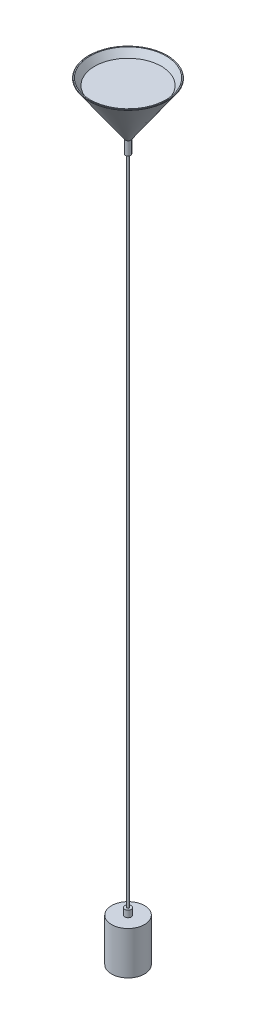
ISO-10303-21;
HEADER;
FILE_DESCRIPTION(('STEP AP214'),'2;1');
FILE_NAME('part.step','',(''),(''),'','','');
FILE_SCHEMA(('AUTOMOTIVE_DESIGN { 1 0 10303 214 1 1 1 1 }'));
ENDSEC;
DATA;
#1=APPLICATION_CONTEXT('core data for automotive mechanical design processes');
#2=APPLICATION_PROTOCOL_DEFINITION('international standard','automotive_design',2000,#1);
#3=PRODUCT_CONTEXT('',#1,'mechanical');
#4=PRODUCT('Part','Part','',(#3));
#5=PRODUCT_RELATED_PRODUCT_CATEGORY('part','',(#4));
#6=PRODUCT_DEFINITION_FORMATION('','',#4);
#7=PRODUCT_DEFINITION_CONTEXT('part definition',#1,'design');
#8=PRODUCT_DEFINITION('design','',#6,#7);
#9=PRODUCT_DEFINITION_SHAPE('','',#8);
#10=(LENGTH_UNIT() NAMED_UNIT(*) SI_UNIT(.MILLI.,.METRE.));
#11=(NAMED_UNIT(*) PLANE_ANGLE_UNIT() SI_UNIT($,.RADIAN.));
#12=(NAMED_UNIT(*) SI_UNIT($,.STERADIAN.) SOLID_ANGLE_UNIT());
#13=UNCERTAINTY_MEASURE_WITH_UNIT(LENGTH_MEASURE(1.E-05),#10,'distance_accuracy_value','');
#14=(GEOMETRIC_REPRESENTATION_CONTEXT(3) GLOBAL_UNCERTAINTY_ASSIGNED_CONTEXT((#13)) GLOBAL_UNIT_ASSIGNED_CONTEXT((#10,
#11,#12)) REPRESENTATION_CONTEXT('',''));
#15=CARTESIAN_POINT('',(0.,0.,0.));
#16=DIRECTION('',(0.,0.,1.));
#17=DIRECTION('',(1.,0.,0.));
#18=AXIS2_PLACEMENT_3D('',#15,#16,#17);
#19=CARTESIAN_POINT('',(0.,-1010.,0.));
#20=DIRECTION('',(0.,-1.,0.));
#21=DIRECTION('',(0.,0.,-1.));
#22=AXIS2_PLACEMENT_3D('',#19,#20,#21);
#23=CYLINDRICAL_SURFACE('',#22,5.);
#24=CARTESIAN_POINT('',(0.,-1010.,0.));
#25=DIRECTION('',(0.,1.,0.));
#26=DIRECTION('',(0.,0.,1.));
#27=AXIS2_PLACEMENT_3D('',#24,#25,#26);
#28=CIRCLE('',#27,5.);
#29=CARTESIAN_POINT('',(0.,-1010.,5.));
#30=VERTEX_POINT('',#29);
#31=EDGE_CURVE('E11',#30,#30,#28,.T.);
#32=ORIENTED_EDGE('',*,*,#31,.F.);
#33=EDGE_LOOP('',(#32));
#34=FACE_BOUND('',#33,.T.);
#35=CARTESIAN_POINT('',(0.,-1020.,0.));
#36=DIRECTION('',(0.,1.,0.));
#37=DIRECTION('',(0.,0.,1.));
#38=AXIS2_PLACEMENT_3D('',#35,#36,#37);
#39=CIRCLE('',#38,5.);
#40=CARTESIAN_POINT('',(0.,-1020.,5.));
#41=VERTEX_POINT('',#40);
#42=EDGE_CURVE('E44',#41,#41,#39,.T.);
#43=ORIENTED_EDGE('',*,*,#42,.T.);
#44=EDGE_LOOP('',(#43));
#45=FACE_BOUND('',#44,.T.);
#46=ADVANCED_FACE('F41',(#34,#45),#23,.T.);
#47=CARTESIAN_POINT('',(0.,-1010.,0.));
#48=DIRECTION('',(0.,1.,0.));
#49=DIRECTION('',(0.,0.,1.));
#50=AXIS2_PLACEMENT_3D('',#47,#48,#49);
#51=PLANE('',#50);
#52=ORIENTED_EDGE('',*,*,#31,.T.);
#53=EDGE_LOOP('',(#52));
#54=FACE_BOUND('',#53,.T.);
#55=ADVANCED_FACE('F56',(#54),#51,.T.);
#56=CARTESIAN_POINT('',(0.,-1020.,0.));
#57=DIRECTION('',(0.,1.,0.));
#58=DIRECTION('',(0.,0.,1.));
#59=AXIS2_PLACEMENT_3D('',#56,#57,#58);
#60=PLANE('',#59);
#61=ORIENTED_EDGE('',*,*,#42,.F.);
#62=EDGE_LOOP('',(#61));
#63=FACE_BOUND('',#62,.T.);
#64=ADVANCED_FACE('F54',(#63),#60,.F.);
#65=CLOSED_SHELL('',(#46,#55,#64));
#66=MANIFOLD_SOLID_BREP('B2',#65);
#67=CARTESIAN_POINT('',(0.,-1085.,0.));
#68=DIRECTION('',(0.,1.,0.));
#69=DIRECTION('',(0.,0.,1.));
#70=AXIS2_PLACEMENT_3D('',#67,#68,#69);
#71=CYLINDRICAL_SURFACE('',#70,25.);
#72=CARTESIAN_POINT('',(0.,-1085.,0.));
#73=DIRECTION('',(0.,-1.,0.));
#74=DIRECTION('',(0.,0.,-1.));
#75=AXIS2_PLACEMENT_3D('',#72,#73,#74);
#76=CIRCLE('',#75,25.);
#77=CARTESIAN_POINT('',(0.,-1085.,-25.));
#78=VERTEX_POINT('',#77);
#79=EDGE_CURVE('E40',#78,#78,#76,.T.);
#80=ORIENTED_EDGE('',*,*,#79,.F.);
#81=EDGE_LOOP('',(#80));
#82=FACE_BOUND('',#81,.T.);
#83=CARTESIAN_POINT('',(0.,-1020.,0.));
#84=DIRECTION('',(0.,-1.,0.));
#85=DIRECTION('',(0.,0.,-1.));
#86=AXIS2_PLACEMENT_3D('',#83,#84,#85);
#87=CIRCLE('',#86,25.);
#88=CARTESIAN_POINT('',(0.,-1020.,-25.));
#89=VERTEX_POINT('',#88);
#90=EDGE_CURVE('E92',#89,#89,#87,.T.);
#91=ORIENTED_EDGE('',*,*,#90,.T.);
#92=EDGE_LOOP('',(#91));
#93=FACE_BOUND('',#92,.T.);
#94=ADVANCED_FACE('F89',(#82,#93),#71,.T.);
#95=CARTESIAN_POINT('',(0.,-1085.,0.));
#96=DIRECTION('',(0.,-1.,0.));
#97=DIRECTION('',(0.,0.,-1.));
#98=AXIS2_PLACEMENT_3D('',#95,#96,#97);
#99=PLANE('',#98);
#100=ORIENTED_EDGE('',*,*,#79,.T.);
#101=EDGE_LOOP('',(#100));
#102=FACE_BOUND('',#101,.T.);
#103=ADVANCED_FACE('F104',(#102),#99,.T.);
#104=CARTESIAN_POINT('',(0.,-1020.,0.));
#105=DIRECTION('',(0.,-1.,0.));
#106=DIRECTION('',(0.,0.,-1.));
#107=AXIS2_PLACEMENT_3D('',#104,#105,#106);
#108=PLANE('',#107);
#109=ORIENTED_EDGE('',*,*,#90,.F.);
#110=EDGE_LOOP('',(#109));
#111=FACE_BOUND('',#110,.T.);
#112=ADVANCED_FACE('F102',(#111),#108,.F.);
#113=CLOSED_SHELL('',(#94,#103,#112));
#114=MANIFOLD_SOLID_BREP('B6',#113);
#115=CARTESIAN_POINT('',(0.,-1020.,0.));
#116=DIRECTION('',(0.,1.,0.));
#117=DIRECTION('',(0.,0.,1.));
#118=AXIS2_PLACEMENT_3D('',#115,#116,#117);
#119=CYLINDRICAL_SURFACE('',#118,1.5);
#120=CARTESIAN_POINT('',(0.,-1020.,0.));
#121=DIRECTION('',(0.,-1.,0.));
#122=DIRECTION('',(0.,0.,-1.));
#123=AXIS2_PLACEMENT_3D('',#120,#121,#122);
#124=CIRCLE('',#123,1.5);
#125=CARTESIAN_POINT('',(0.,-1020.,-1.5));
#126=VERTEX_POINT('',#125);
#127=EDGE_CURVE('E88',#126,#126,#124,.T.);
#128=ORIENTED_EDGE('',*,*,#127,.F.);
#129=EDGE_LOOP('',(#128));
#130=FACE_BOUND('',#129,.T.);
#131=CARTESIAN_POINT('',(0.,-20.,0.));
#132=DIRECTION('',(0.,-1.,0.));
#133=DIRECTION('',(0.,0.,-1.));
#134=AXIS2_PLACEMENT_3D('',#131,#132,#133);
#135=CIRCLE('',#134,1.5);
#136=CARTESIAN_POINT('',(0.,-20.,-1.5));
#137=VERTEX_POINT('',#136);
#138=EDGE_CURVE('E140',#137,#137,#135,.T.);
#139=ORIENTED_EDGE('',*,*,#138,.T.);
#140=EDGE_LOOP('',(#139));
#141=FACE_BOUND('',#140,.T.);
#142=ADVANCED_FACE('F137',(#130,#141),#119,.T.);
#143=CARTESIAN_POINT('',(0.,-1020.,0.));
#144=DIRECTION('',(0.,-1.,0.));
#145=DIRECTION('',(0.,0.,-1.));
#146=AXIS2_PLACEMENT_3D('',#143,#144,#145);
#147=PLANE('',#146);
#148=ORIENTED_EDGE('',*,*,#127,.T.);
#149=EDGE_LOOP('',(#148));
#150=FACE_BOUND('',#149,.T.);
#151=ADVANCED_FACE('F152',(#150),#147,.T.);
#152=CARTESIAN_POINT('',(0.,-20.,0.));
#153=DIRECTION('',(0.,-1.,0.));
#154=DIRECTION('',(0.,0.,-1.));
#155=AXIS2_PLACEMENT_3D('',#152,#153,#154);
#156=PLANE('',#155);
#157=ORIENTED_EDGE('',*,*,#138,.F.);
#158=EDGE_LOOP('',(#157));
#159=FACE_BOUND('',#158,.T.);
#160=ADVANCED_FACE('F150',(#159),#156,.F.);
#161=CLOSED_SHELL('',(#142,#151,#160));
#162=MANIFOLD_SOLID_BREP('B35',#161);
#163=CARTESIAN_POINT('',(0.,-20.,0.));
#164=DIRECTION('',(0.,1.,0.));
#165=DIRECTION('',(0.,0.,1.));
#166=AXIS2_PLACEMENT_3D('',#163,#164,#165);
#167=CYLINDRICAL_SURFACE('',#166,4.);
#168=CARTESIAN_POINT('',(0.,-20.,0.));
#169=DIRECTION('',(0.,-1.,0.));
#170=DIRECTION('',(0.,0.,-1.));
#171=AXIS2_PLACEMENT_3D('',#168,#169,#170);
#172=CIRCLE('',#171,4.);
#173=CARTESIAN_POINT('',(0.,-20.,-4.));
#174=VERTEX_POINT('',#173);
#175=EDGE_CURVE('E136',#174,#174,#172,.T.);
#176=ORIENTED_EDGE('',*,*,#175,.F.);
#177=EDGE_LOOP('',(#176));
#178=FACE_BOUND('',#177,.T.);
#179=CARTESIAN_POINT('',(0.,0.,0.));
#180=DIRECTION('',(0.,-1.,0.));
#181=DIRECTION('',(0.,0.,-1.));
#182=AXIS2_PLACEMENT_3D('',#179,#180,#181);
#183=CIRCLE('',#182,4.);
#184=CARTESIAN_POINT('',(0.,0.,-4.));
#185=VERTEX_POINT('',#184);
#186=EDGE_CURVE('E188',#185,#185,#183,.T.);
#187=ORIENTED_EDGE('',*,*,#186,.T.);
#188=EDGE_LOOP('',(#187));
#189=FACE_BOUND('',#188,.T.);
#190=ADVANCED_FACE('F185',(#178,#189),#167,.T.);
#191=CARTESIAN_POINT('',(0.,-20.,0.));
#192=DIRECTION('',(0.,-1.,0.));
#193=DIRECTION('',(0.,0.,-1.));
#194=AXIS2_PLACEMENT_3D('',#191,#192,#193);
#195=PLANE('',#194);
#196=ORIENTED_EDGE('',*,*,#175,.T.);
#197=EDGE_LOOP('',(#196));
#198=FACE_BOUND('',#197,.T.);
#199=ADVANCED_FACE('F200',(#198),#195,.T.);
#200=CARTESIAN_POINT('',(0.,0.,0.));
#201=DIRECTION('',(0.,-1.,0.));
#202=DIRECTION('',(0.,0.,-1.));
#203=AXIS2_PLACEMENT_3D('',#200,#201,#202);
#204=PLANE('',#203);
#205=ORIENTED_EDGE('',*,*,#186,.F.);
#206=EDGE_LOOP('',(#205));
#207=FACE_BOUND('',#206,.T.);
#208=ADVANCED_FACE('F198',(#207),#204,.F.);
#209=CLOSED_SHELL('',(#190,#199,#208));
#210=MANIFOLD_SOLID_BREP('B83',#209);
#211=CARTESIAN_POINT('',(0.,69.5,0.));
#212=DIRECTION('',(0.,-1.,0.));
#213=DIRECTION('',(1.,0.,0.));
#214=AXIS2_PLACEMENT_3D('',#211,#212,#213);
#215=PLANE('',#214);
#216=CARTESIAN_POINT('',(0.,69.5,0.));
#217=DIRECTION('',(0.,-1.,0.));
#218=DIRECTION('',(1.,0.,0.));
#219=AXIS2_PLACEMENT_3D('',#216,#217,#218);
#220=CIRCLE('',#219,50.3735945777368);
#221=CARTESIAN_POINT('',(50.3735945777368,69.5,0.));
#222=VERTEX_POINT('',#221);
#223=EDGE_CURVE('E184',#222,#222,#220,.T.);
#224=ORIENTED_EDGE('',*,*,#223,.T.);
#225=EDGE_LOOP('',(#224));
#226=FACE_BOUND('',#225,.T.);
#227=ADVANCED_FACE('F232',(#226),#215,.T.);
#228=CARTESIAN_POINT('',(0.,69.5,0.));
#229=DIRECTION('',(0.,1.,0.));
#230=DIRECTION('',(-1.,0.,0.));
#231=AXIS2_PLACEMENT_3D('',#228,#229,#230);
#232=CONICAL_SURFACE('',#231,50.3735945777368,0.718829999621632);
#233=CARTESIAN_POINT('',(0.,70.,0.));
#234=DIRECTION('',(0.,-1.,0.));
#235=DIRECTION('',(1.,0.,0.));
#236=AXIS2_PLACEMENT_3D('',#233,#234,#235);
#237=CIRCLE('',#236,50.8110945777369);
#238=CARTESIAN_POINT('',(50.8110945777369,70.,0.));
#239=VERTEX_POINT('',#238);
#240=EDGE_CURVE('E238',#239,#239,#237,.T.);
#241=ORIENTED_EDGE('',*,*,#240,.T.);
#242=EDGE_LOOP('',(#241));
#243=FACE_BOUND('',#242,.T.);
#244=ORIENTED_EDGE('',*,*,#223,.F.);
#245=EDGE_LOOP('',(#244));
#246=FACE_BOUND('',#245,.T.);
#247=ADVANCED_FACE('F244',(#243,#246),#232,.T.);
#248=CARTESIAN_POINT('',(0.,70.,0.));
#249=DIRECTION('',(0.,1.,0.));
#250=DIRECTION('',(-1.,0.,0.));
#251=AXIS2_PLACEMENT_3D('',#248,#249,#250);
#252=PLANE('',#251);
#253=ORIENTED_EDGE('',*,*,#240,.F.);
#254=EDGE_LOOP('',(#253));
#255=FACE_BOUND('',#254,.T.);
#256=ADVANCED_FACE('F247',(#255),#252,.T.);
#257=CLOSED_SHELL('',(#227,#247,#256));
#258=MANIFOLD_SOLID_BREP('B131',#257);
#259=CARTESIAN_POINT('',(0.,0.,0.));
#260=DIRECTION('',(0.,1.,0.));
#261=DIRECTION('',(0.,0.,1.));
#262=AXIS2_PLACEMENT_3D('',#259,#260,#261);
#263=PLANE('',#262);
#264=CARTESIAN_POINT('',(0.,0.,0.));
#265=DIRECTION('',(0.,-1.,0.));
#266=DIRECTION('',(0.,0.,-1.));
#267=AXIS2_PLACEMENT_3D('',#264,#265,#266);
#268=CIRCLE('',#267,4.);
#269=CARTESIAN_POINT('',(0.,0.,3.99999999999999));
#270=VERTEX_POINT('',#269);
#271=EDGE_CURVE('E283',#270,#270,#268,.T.);
#272=ORIENTED_EDGE('',*,*,#271,.T.);
#273=EDGE_LOOP('',(#272));
#274=FACE_BOUND('',#273,.T.);
#275=ADVANCED_FACE('F272',(#274),#263,.F.);
#276=CARTESIAN_POINT('',(0.,80.,0.));
#277=DIRECTION('',(0.,1.,0.));
#278=DIRECTION('',(0.,0.,1.));
#279=AXIS2_PLACEMENT_3D('',#276,#277,#278);
#280=CONICAL_SURFACE('',#279,60.,0.610725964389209);
#281=CARTESIAN_POINT('',(0.,79.2132688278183,0.));
#282=DIRECTION('',(0.,-1.,0.));
#283=DIRECTION('',(0.,0.,-1.));
#284=AXIS2_PLACEMENT_3D('',#281,#282,#283);
#285=CIRCLE('',#284,59.4492881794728);
#286=CARTESIAN_POINT('',(0.,79.2132688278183,59.4492881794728));
#287=VERTEX_POINT('',#286);
#288=EDGE_CURVE('E279',#287,#287,#285,.T.);
#289=CARTESIAN_POINT('',(0.,79.2132688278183,59.4492881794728));
#290=CARTESIAN_POINT('',(0.,78.3881306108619,58.8716914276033));
#291=CARTESIAN_POINT('',(0.,77.5629923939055,58.2940946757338));
#292=CARTESIAN_POINT('',(0.,75.9127159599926,57.1389011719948));
#293=CARTESIAN_POINT('',(0.,75.0875777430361,56.5613044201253));
#294=CARTESIAN_POINT('',(0.,73.4373013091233,55.4061109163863));
#295=CARTESIAN_POINT('',(0.,72.6121630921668,54.8285141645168));
#296=CARTESIAN_POINT('',(0.,70.9618866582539,53.6733206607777));
#297=CARTESIAN_POINT('',(0.,70.1367484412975,53.0957239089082));
#298=CARTESIAN_POINT('',(0.,68.4864720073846,51.9405304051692));
#299=CARTESIAN_POINT('',(0.,67.6613337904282,51.3629336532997));
#300=CARTESIAN_POINT('',(0.,66.0110573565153,50.2077401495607));
#301=CARTESIAN_POINT('',(0.,65.1859191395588,49.6301433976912));
#302=CARTESIAN_POINT('',(0.,63.535642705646,48.4749498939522));
#303=CARTESIAN_POINT('',(0.,62.7105044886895,47.8973531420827));
#304=CARTESIAN_POINT('',(0.,61.0602280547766,46.7421596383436));
#305=CARTESIAN_POINT('',(0.,60.2350898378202,46.1645628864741));
#306=CARTESIAN_POINT('',(0.,58.5848134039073,45.0093693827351));
#307=CARTESIAN_POINT('',(0.,57.7596751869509,44.4317726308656));
#308=CARTESIAN_POINT('',(0.,56.109398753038,43.2765791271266));
#309=CARTESIAN_POINT('',(0.,55.2842605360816,42.6989823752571));
#310=CARTESIAN_POINT('',(0.,53.6339841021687,41.5437888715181));
#311=CARTESIAN_POINT('',(0.,52.8088458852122,40.9661921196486));
#312=CARTESIAN_POINT('',(0.,51.1585694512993,39.8109986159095));
#313=CARTESIAN_POINT('',(0.,50.3334312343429,39.23340186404));
#314=CARTESIAN_POINT('',(0.,48.68315480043,38.078208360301));
#315=CARTESIAN_POINT('',(0.,47.8580165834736,37.5006116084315));
#316=CARTESIAN_POINT('',(0.,46.2077401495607,36.3454181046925));
#317=CARTESIAN_POINT('',(0.,45.3826019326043,35.767821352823));
#318=CARTESIAN_POINT('',(0.,43.7323254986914,34.612627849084));
#319=CARTESIAN_POINT('',(0.,42.9071872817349,34.0350310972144));
#320=CARTESIAN_POINT('',(0.,41.256910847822,32.8798375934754));
#321=CARTESIAN_POINT('',(0.,40.4317726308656,32.3022408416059));
#322=CARTESIAN_POINT('',(0.,38.7814961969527,31.1470473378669));
#323=CARTESIAN_POINT('',(0.,37.9563579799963,30.5694505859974));
#324=CARTESIAN_POINT('',(0.,36.3060815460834,29.4142570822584));
#325=CARTESIAN_POINT('',(0.,35.480943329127,28.8366603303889));
#326=CARTESIAN_POINT('',(0.,33.8306668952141,27.6814668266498));
#327=CARTESIAN_POINT('',(0.,33.0055286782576,27.1038700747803));
#328=CARTESIAN_POINT('',(0.,31.3552522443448,25.9486765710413));
#329=CARTESIAN_POINT('',(0.,30.5301140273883,25.3710798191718));
#330=CARTESIAN_POINT('',(0.,28.8798375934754,24.2158863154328));
#331=CARTESIAN_POINT('',(0.,28.054699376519,23.6382895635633));
#332=CARTESIAN_POINT('',(0.,26.4044229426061,22.4830960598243));
#333=CARTESIAN_POINT('',(0.,25.5792847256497,21.9054993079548));
#334=CARTESIAN_POINT('',(0.,23.9290082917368,20.7503058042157));
#335=CARTESIAN_POINT('',(0.,23.1038700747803,20.1727090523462));
#336=CARTESIAN_POINT('',(0.,21.4535936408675,19.0175155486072));
#337=CARTESIAN_POINT('',(0.,20.628455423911,18.4399187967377));
#338=CARTESIAN_POINT('',(0.,18.9781789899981,17.2847252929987));
#339=CARTESIAN_POINT('',(0.,18.1530407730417,16.7071285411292));
#340=CARTESIAN_POINT('',(0.,16.5027643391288,15.5519350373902));
#341=CARTESIAN_POINT('',(0.,15.6776261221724,14.9743382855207));
#342=CARTESIAN_POINT('',(0.,14.0273496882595,13.8191447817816));
#343=CARTESIAN_POINT('',(0.,13.202211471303,13.2415480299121));
#344=CARTESIAN_POINT('',(0.,11.5519350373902,12.0863545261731));
#345=CARTESIAN_POINT('',(0.,10.7267968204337,11.5087577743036));
#346=CARTESIAN_POINT('',(0.,9.07652038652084,10.3535642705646));
#347=CARTESIAN_POINT('',(0.,8.2513821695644,9.77596751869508));
#348=CARTESIAN_POINT('',(0.,6.60110573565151,8.62077401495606));
#349=CARTESIAN_POINT('',(0.,5.77596751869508,8.04317726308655));
#350=CARTESIAN_POINT('',(0.,4.12569108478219,6.88798375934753));
#351=CARTESIAN_POINT('',(0.,3.30055286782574,6.31038700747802));
#352=CARTESIAN_POINT('',(0.,1.65027643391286,5.155193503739));
#353=CARTESIAN_POINT('',(0.,0.825138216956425,4.5775967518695));
#354=CARTESIAN_POINT('',(0.,0.,3.99999999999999));
#355=B_SPLINE_CURVE_WITH_KNOTS('',3,(#289,#290,#291,#292,#293,#294,#295,#296,#297,#298,#299,
#300,#301,#302,#303,#304,#305,#306,#307,#308,#309,#310,#311,#312,#313,#314,#315,#316,#317,#318,
#319,#320,#321,#322,#323,#324,#325,#326,#327,#328,#329,#330,#331,#332,#333,#334,#335,#336,#337,
#338,#339,#340,#341,#342,#343,#344,#345,#346,#347,#348,#349,#350,#351,#352,#353,#354),
.UNSPECIFIED.,.F.,.F.,(4,2,2,2,2,2,2,2,2,2,2,2,2,2,2,2,2,2,2,2,2,2,2,2,2,2,2,2,2,2,2,2,4),(0.,
3.02162866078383,6.04325732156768,9.06488598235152,12.0865146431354,15.1081433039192,
18.1297719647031,21.1514006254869,24.1730292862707,27.1946579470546,30.2162866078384,
33.2379152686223,36.2595439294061,39.28117259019,42.3028012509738,45.3244299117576,
48.3460585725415,51.3676872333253,54.3893158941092,57.410944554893,60.4325732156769,
63.4542018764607,66.4758305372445,69.4974591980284,72.5190878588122,75.5407165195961,
78.5623451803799,81.5839738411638,84.6056025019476,87.6272311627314,90.6488598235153,
93.6704884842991,96.692117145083),.UNSPECIFIED.);
#356=EDGE_CURVE('BSEAM308',#287,#270,#355,.T.);
#357=ORIENTED_EDGE('',*,*,#288,.T.);
#358=ORIENTED_EDGE('',*,*,#271,.F.);
#359=ORIENTED_EDGE('',*,*,#356,.T.);
#360=ORIENTED_EDGE('',*,*,#356,.F.);
#361=EDGE_LOOP('',(#357,#359,#358,#360));
#362=FACE_BOUND('',#361,.T.);
#363=ADVANCED_FACE('F308',(#362),#280,.T.);
#364=CARTESIAN_POINT('',(-60.,80.,0.));
#365=DIRECTION('',(0.,-1.,0.));
#366=DIRECTION('',(0.,0.,-1.));
#367=AXIS2_PLACEMENT_3D('',#364,#365,#366);
#368=PLANE('',#367);
#369=CARTESIAN_POINT('',(0.,80.,0.));
#370=DIRECTION('',(0.,-1.,0.));
#371=DIRECTION('',(0.,0.,-1.));
#372=AXIS2_PLACEMENT_3D('',#369,#370,#371);
#373=CIRCLE('',#372,59.0396722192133);
#374=CARTESIAN_POINT('',(0.,80.,-59.0396722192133));
#375=VERTEX_POINT('',#374);
#376=EDGE_CURVE('E231',#375,#375,#373,.F.);
#377=ORIENTED_EDGE('',*,*,#376,.T.);
#378=EDGE_LOOP('',(#377));
#379=FACE_BOUND('',#378,.T.);
#380=CARTESIAN_POINT('',(0.,80.,0.));
#381=DIRECTION('',(0.,-1.,0.));
#382=DIRECTION('',(0.,0.,-1.));
#383=AXIS2_PLACEMENT_3D('',#380,#381,#382);
#384=CIRCLE('',#383,57.5586888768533);
#385=CARTESIAN_POINT('',(0.,80.,57.5586888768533));
#386=VERTEX_POINT('',#385);
#387=EDGE_CURVE('E290',#386,#386,#384,.T.);
#388=ORIENTED_EDGE('',*,*,#387,.T.);
#389=EDGE_LOOP('',(#388));
#390=FACE_BOUND('',#389,.T.);
#391=ADVANCED_FACE('F301',(#379,#390),#368,.F.);
#392=CARTESIAN_POINT('',(0.,2.,0.));
#393=DIRECTION('',(0.,1.,0.));
#394=DIRECTION('',(0.,0.,1.));
#395=AXIS2_PLACEMENT_3D('',#392,#393,#394);
#396=PLANE('',#395);
#397=CARTESIAN_POINT('',(0.,2.,0.));
#398=DIRECTION('',(0.,1.,0.));
#399=DIRECTION('',(0.,0.,1.));
#400=AXIS2_PLACEMENT_3D('',#397,#398,#399);
#401=CIRCLE('',#400,2.95868887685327);
#402=CARTESIAN_POINT('',(0.,1.99999999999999,2.95868887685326));
#403=VERTEX_POINT('',#402);
#404=EDGE_CURVE('E287',#403,#403,#401,.F.);
#405=ORIENTED_EDGE('',*,*,#404,.F.);
#406=EDGE_LOOP('',(#405));
#407=FACE_BOUND('',#406,.T.);
#408=ADVANCED_FACE('F299',(#407),#396,.T.);
#409=CARTESIAN_POINT('',(0.,81.1469246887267,0.));
#410=DIRECTION('',(0.,1.,0.));
#411=DIRECTION('',(0.,0.,1.));
#412=AXIS2_PLACEMENT_3D('',#409,#410,#411);
#413=CONICAL_SURFACE('',#412,58.3615361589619,0.610725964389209);
#414=CARTESIAN_POINT('',(0.,1.99999999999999,2.95868887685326));
#415=CARTESIAN_POINT('',(0.,2.81249999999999,3.52743887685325));
#416=CARTESIAN_POINT('',(0.,3.62499999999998,4.09618887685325));
#417=CARTESIAN_POINT('',(0.,5.24999999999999,5.23368887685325));
#418=CARTESIAN_POINT('',(0.,6.06249999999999,5.80243887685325));
#419=CARTESIAN_POINT('',(0.,7.68749999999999,6.93993887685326));
#420=CARTESIAN_POINT('',(0.,8.49999999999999,7.50868887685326));
#421=CARTESIAN_POINT('',(0.,10.125,8.64618887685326));
#422=CARTESIAN_POINT('',(0.,10.9375,9.21493887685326));
#423=CARTESIAN_POINT('',(0.,12.5625,10.3524388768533));
#424=CARTESIAN_POINT('',(0.,13.375,10.9211888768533));
#425=CARTESIAN_POINT('',(0.,15.,12.0586888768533));
#426=CARTESIAN_POINT('',(0.,15.8125,12.6274388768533));
#427=CARTESIAN_POINT('',(0.,17.4375,13.7649388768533));
#428=CARTESIAN_POINT('',(0.,18.25,14.3336888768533));
#429=CARTESIAN_POINT('',(0.,19.875,15.4711888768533));
#430=CARTESIAN_POINT('',(0.,20.6875,16.0399388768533));
#431=CARTESIAN_POINT('',(0.,22.3125,17.1774388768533));
#432=CARTESIAN_POINT('',(0.,23.125,17.7461888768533));
#433=CARTESIAN_POINT('',(0.,24.75,18.8836888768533));
#434=CARTESIAN_POINT('',(0.,25.5625,19.4524388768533));
#435=CARTESIAN_POINT('',(0.,27.1875,20.5899388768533));
#436=CARTESIAN_POINT('',(0.,28.,21.1586888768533));
#437=CARTESIAN_POINT('',(0.,29.625,22.2961888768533));
#438=CARTESIAN_POINT('',(0.,30.4375,22.8649388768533));
#439=CARTESIAN_POINT('',(0.,32.0625,24.0024388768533));
#440=CARTESIAN_POINT('',(0.,32.875,24.5711888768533));
#441=CARTESIAN_POINT('',(0.,34.5,25.7086888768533));
#442=CARTESIAN_POINT('',(0.,35.3125,26.2774388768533));
#443=CARTESIAN_POINT('',(0.,36.9375,27.4149388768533));
#444=CARTESIAN_POINT('',(0.,37.75,27.9836888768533));
#445=CARTESIAN_POINT('',(0.,39.375,29.1211888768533));
#446=CARTESIAN_POINT('',(0.,40.1875,29.6899388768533));
#447=CARTESIAN_POINT('',(0.,41.8125,30.8274388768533));
#448=CARTESIAN_POINT('',(0.,42.625,31.3961888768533));
#449=CARTESIAN_POINT('',(0.,44.25,32.5336888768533));
#450=CARTESIAN_POINT('',(0.,45.0625,33.1024388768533));
#451=CARTESIAN_POINT('',(0.,46.6875,34.2399388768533));
#452=CARTESIAN_POINT('',(0.,47.5,34.8086888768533));
#453=CARTESIAN_POINT('',(0.,49.125,35.9461888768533));
#454=CARTESIAN_POINT('',(0.,49.9375,36.5149388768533));
#455=CARTESIAN_POINT('',(0.,51.5625,37.6524388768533));
#456=CARTESIAN_POINT('',(0.,52.375,38.2211888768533));
#457=CARTESIAN_POINT('',(0.,54.,39.3586888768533));
#458=CARTESIAN_POINT('',(0.,54.8125,39.9274388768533));
#459=CARTESIAN_POINT('',(0.,56.4375,41.0649388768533));
#460=CARTESIAN_POINT('',(0.,57.25,41.6336888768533));
#461=CARTESIAN_POINT('',(0.,58.875,42.7711888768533));
#462=CARTESIAN_POINT('',(0.,59.6875,43.3399388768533));
#463=CARTESIAN_POINT('',(0.,61.3125,44.4774388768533));
#464=CARTESIAN_POINT('',(0.,62.125,45.0461888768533));
#465=CARTESIAN_POINT('',(0.,63.75,46.1836888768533));
#466=CARTESIAN_POINT('',(0.,64.5625,46.7524388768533));
#467=CARTESIAN_POINT('',(0.,66.1875,47.8899388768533));
#468=CARTESIAN_POINT('',(0.,67.,48.4586888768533));
#469=CARTESIAN_POINT('',(0.,68.625,49.5961888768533));
#470=CARTESIAN_POINT('',(0.,69.4375,50.1649388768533));
#471=CARTESIAN_POINT('',(0.,71.0625,51.3024388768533));
#472=CARTESIAN_POINT('',(0.,71.875,51.8711888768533));
#473=CARTESIAN_POINT('',(0.,73.5,53.0086888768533));
#474=CARTESIAN_POINT('',(0.,74.3125,53.5774388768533));
#475=CARTESIAN_POINT('',(0.,75.9375,54.7149388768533));
#476=CARTESIAN_POINT('',(0.,76.75,55.2836888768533));
#477=CARTESIAN_POINT('',(0.,78.375,56.4211888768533));
#478=CARTESIAN_POINT('',(0.,79.1875,56.9899388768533));
#479=CARTESIAN_POINT('',(0.,80.,57.5586888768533));
#480=B_SPLINE_CURVE_WITH_KNOTS('',3,(#414,#415,#416,#417,#418,#419,#420,#421,#422,#423,#424,
#425,#426,#427,#428,#429,#430,#431,#432,#433,#434,#435,#436,#437,#438,#439,#440,#441,#442,#443,
#444,#445,#446,#447,#448,#449,#450,#451,#452,#453,#454,#455,#456,#457,#458,#459,#460,#461,#462,
#463,#464,#465,#466,#467,#468,#469,#470,#471,#472,#473,#474,#475,#476,#477,#478,#479),
.UNSPECIFIED.,.F.,.F.,(4,2,2,2,2,2,2,2,2,2,2,2,2,2,2,2,2,2,2,2,2,2,2,2,2,2,2,2,2,2,2,2,4),(0.,
2.97534793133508,5.95069586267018,8.92604379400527,11.9013917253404,14.8767396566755,
17.8520875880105,20.8274355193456,23.8027834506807,26.7781313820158,29.7534793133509,
32.728827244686,35.7041751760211,38.6795231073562,41.6548710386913,44.6302189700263,
47.6055669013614,50.5809148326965,53.5562627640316,56.5316106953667,59.5069586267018,
62.4823065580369,65.457654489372,68.4330024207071,71.4083503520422,74.3836982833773,
77.3590462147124,80.3343941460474,83.3097420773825,86.2850900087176,89.2604379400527,
92.2357858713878,95.2111338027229),.UNSPECIFIED.);
#481=EDGE_CURVE('BSEAM296',#403,#386,#480,.T.);
#482=ORIENTED_EDGE('',*,*,#404,.T.);
#483=ORIENTED_EDGE('',*,*,#387,.F.);
#484=ORIENTED_EDGE('',*,*,#481,.T.);
#485=ORIENTED_EDGE('',*,*,#481,.F.);
#486=EDGE_LOOP('',(#482,#484,#483,#485));
#487=FACE_BOUND('',#486,.T.);
#488=ADVANCED_FACE('F296',(#487),#413,.F.);
#489=CARTESIAN_POINT('',(0.,79.5,0.));
#490=DIRECTION('',(0.,-1.,0.));
#491=DIRECTION('',(0.,0.,-1.));
#492=AXIS2_PLACEMENT_3D('',#489,#490,#491);
#493=TOROIDAL_SURFACE('',#492,59.0396722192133,0.5);
#494=ORIENTED_EDGE('',*,*,#376,.F.);
#495=EDGE_LOOP('',(#494));
#496=FACE_BOUND('',#495,.T.);
#497=ORIENTED_EDGE('',*,*,#288,.F.);
#498=EDGE_LOOP('',(#497));
#499=FACE_BOUND('',#498,.T.);
#500=ADVANCED_FACE('F274',(#496,#499),#493,.T.);
#501=CLOSED_SHELL('',(#275,#363,#391,#408,#488,#500));
#502=MANIFOLD_SOLID_BREP('B179',#501);
#503=ADVANCED_BREP_SHAPE_REPRESENTATION('',(#18,#66,#114,#162,#210,#258,#502),#14);
#504=SHAPE_DEFINITION_REPRESENTATION(#9,#503);
ENDSEC;
END-ISO-10303-21;
